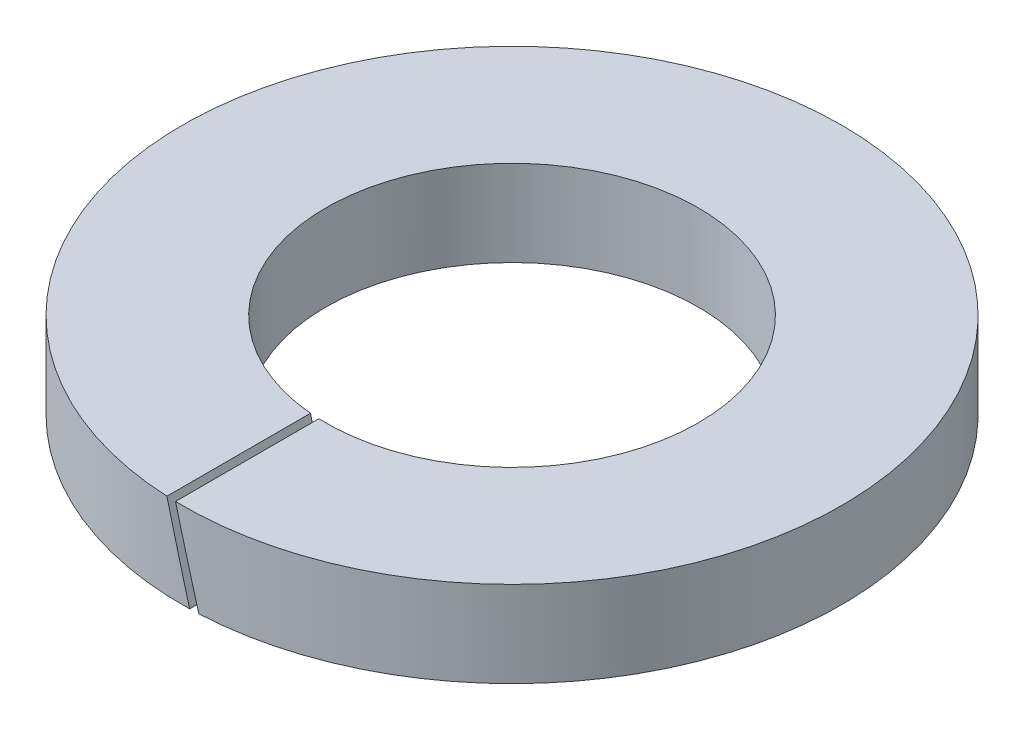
ISO-10303-21;
HEADER;
FILE_DESCRIPTION(('STEP AP214'),'2;1');
FILE_NAME('part.step','',(''),(''),'','','');
FILE_SCHEMA(('AUTOMOTIVE_DESIGN { 1 0 10303 214 1 1 1 1 }'));
ENDSEC;
DATA;
#1=APPLICATION_CONTEXT('core data for automotive mechanical design processes');
#2=APPLICATION_PROTOCOL_DEFINITION('international standard','automotive_design',2000,#1);
#3=PRODUCT_CONTEXT('',#1,'mechanical');
#4=PRODUCT('Part','Part','',(#3));
#5=PRODUCT_RELATED_PRODUCT_CATEGORY('part','',(#4));
#6=PRODUCT_DEFINITION_FORMATION('','',#4);
#7=PRODUCT_DEFINITION_CONTEXT('part definition',#1,'design');
#8=PRODUCT_DEFINITION('design','',#6,#7);
#9=PRODUCT_DEFINITION_SHAPE('','',#8);
#10=(LENGTH_UNIT() NAMED_UNIT(*) SI_UNIT(.MILLI.,.METRE.));
#11=(NAMED_UNIT(*) PLANE_ANGLE_UNIT() SI_UNIT($,.RADIAN.));
#12=(NAMED_UNIT(*) SI_UNIT($,.STERADIAN.) SOLID_ANGLE_UNIT());
#13=UNCERTAINTY_MEASURE_WITH_UNIT(LENGTH_MEASURE(1.E-05),#10,'distance_accuracy_value','');
#14=(GEOMETRIC_REPRESENTATION_CONTEXT(3) GLOBAL_UNCERTAINTY_ASSIGNED_CONTEXT((#13)) GLOBAL_UNIT_ASSIGNED_CONTEXT((#10,
#11,#12)) REPRESENTATION_CONTEXT('',''));
#15=CARTESIAN_POINT('',(0.,0.,0.));
#16=DIRECTION('',(0.,0.,1.));
#17=DIRECTION('',(1.,0.,0.));
#18=AXIS2_PLACEMENT_3D('',#15,#16,#17);
#19=CARTESIAN_POINT('',(0.,0.5,0.));
#20=DIRECTION('',(0.,1.,0.));
#21=DIRECTION('',(0.,0.,1.));
#22=AXIS2_PLACEMENT_3D('',#19,#20,#21);
#23=CYLINDRICAL_SURFACE('',#22,6.5);
#24=CARTESIAN_POINT('',(0.,2.07955549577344,0.));
#25=DIRECTION('',(-0.965925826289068,-0.258819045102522,0.));
#26=DIRECTION('',(-0.258819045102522,0.965925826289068,0.));
#27=AXIS2_PLACEMENT_3D('',#24,#25,#26);
#28=ELLIPSE('',#27,25.1140714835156,6.5);
#29=CARTESIAN_POINT('',(0.5572152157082,0.,6.47607220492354));
#30=VERTEX_POINT('',#29);
#31=CARTESIAN_POINT('',(-0.246632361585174,3.,6.49531927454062));
#32=VERTEX_POINT('',#31);
#33=EDGE_CURVE('E47',#30,#32,#28,.T.);
#34=ORIENTED_EDGE('',*,*,#33,.T.);
#35=CARTESIAN_POINT('',(0.,3.,0.));
#36=DIRECTION('',(0.,1.,0.));
#37=DIRECTION('',(0.,0.,1.));
#38=AXIS2_PLACEMENT_3D('',#35,#36,#37);
#39=CIRCLE('',#38,6.5);
#40=CARTESIAN_POINT('',(-0.557215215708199,3.,6.47607220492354));
#41=VERTEX_POINT('',#40);
#42=EDGE_CURVE('E11',#32,#41,#39,.T.);
#43=ORIENTED_EDGE('',*,*,#42,.T.);
#44=CARTESIAN_POINT('',(0.,0.920444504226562,0.));
#45=DIRECTION('',(-0.965925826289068,-0.258819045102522,0.));
#46=DIRECTION('',(-0.258819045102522,0.965925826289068,0.));
#47=AXIS2_PLACEMENT_3D('',#44,#45,#46);
#48=ELLIPSE('',#47,25.1140714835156,6.5);
#49=CARTESIAN_POINT('',(0.246632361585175,0.,6.49531927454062));
#50=VERTEX_POINT('',#49);
#51=EDGE_CURVE('E96',#50,#41,#48,.T.);
#52=ORIENTED_EDGE('',*,*,#51,.F.);
#53=CARTESIAN_POINT('',(0.,0.,0.));
#54=DIRECTION('',(0.,1.,0.));
#55=DIRECTION('',(0.,0.,1.));
#56=AXIS2_PLACEMENT_3D('',#53,#54,#55);
#57=CIRCLE('',#56,6.5);
#58=EDGE_CURVE('E89',#30,#50,#57,.T.);
#59=ORIENTED_EDGE('',*,*,#58,.F.);
#60=EDGE_LOOP('',(#34,#43,#52,#59));
#61=FACE_BOUND('',#60,.T.);
#62=ADVANCED_FACE('F33',(#61),#23,.F.);
#63=CARTESIAN_POINT('',(6.5,3.,0.));
#64=DIRECTION('',(0.,-1.,0.));
#65=DIRECTION('',(0.,0.,-1.));
#66=AXIS2_PLACEMENT_3D('',#63,#64,#65);
#67=PLANE('',#66);
#68=DIRECTION('',(0.,0.,1.));
#69=VECTOR('',#68,1.);
#70=CARTESIAN_POINT('',(-0.246632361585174,3.,-11.501));
#71=LINE('',#70,#69);
#72=CARTESIAN_POINT('',(-0.246632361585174,3.,11.4973550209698));
#73=VERTEX_POINT('',#72);
#74=EDGE_CURVE('E74',#32,#73,#71,.T.);
#75=ORIENTED_EDGE('',*,*,#74,.T.);
#76=CARTESIAN_POINT('',(0.,3.,0.));
#77=DIRECTION('',(0.,1.,0.));
#78=DIRECTION('',(0.,0.,1.));
#79=AXIS2_PLACEMENT_3D('',#76,#77,#78);
#80=CIRCLE('',#79,11.5);
#81=CARTESIAN_POINT('',(-0.557215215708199,3.,11.4864925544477));
#82=VERTEX_POINT('',#81);
#83=EDGE_CURVE('E40',#73,#82,#80,.T.);
#84=ORIENTED_EDGE('',*,*,#83,.T.);
#85=DIRECTION('',(0.,0.,1.));
#86=VECTOR('',#85,1.);
#87=CARTESIAN_POINT('',(-0.557215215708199,3.,-11.501));
#88=LINE('',#87,#86);
#89=EDGE_CURVE('E98',#41,#82,#88,.T.);
#90=ORIENTED_EDGE('',*,*,#89,.F.);
#91=ORIENTED_EDGE('',*,*,#42,.F.);
#92=EDGE_LOOP('',(#75,#84,#90,#91));
#93=FACE_BOUND('',#92,.T.);
#94=ADVANCED_FACE('F84',(#93),#67,.F.);
#95=CARTESIAN_POINT('',(0.,0.5,0.));
#96=DIRECTION('',(0.,1.,0.));
#97=DIRECTION('',(0.,0.,1.));
#98=AXIS2_PLACEMENT_3D('',#95,#96,#97);
#99=CYLINDRICAL_SURFACE('',#98,11.5);
#100=CARTESIAN_POINT('',(0.,2.07955549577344,0.));
#101=DIRECTION('',(-0.965925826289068,-0.258819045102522,0.));
#102=DIRECTION('',(-0.258819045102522,0.965925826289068,0.));
#103=AXIS2_PLACEMENT_3D('',#100,#101,#102);
#104=ELLIPSE('',#103,44.4325880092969,11.5);
#105=CARTESIAN_POINT('',(0.5572152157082,0.,11.4864925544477));
#106=VERTEX_POINT('',#105);
#107=EDGE_CURVE('E71',#73,#106,#104,.F.);
#108=ORIENTED_EDGE('',*,*,#107,.T.);
#109=CARTESIAN_POINT('',(0.,0.,0.));
#110=DIRECTION('',(0.,1.,0.));
#111=DIRECTION('',(0.,0.,1.));
#112=AXIS2_PLACEMENT_3D('',#109,#110,#111);
#113=CIRCLE('',#112,11.5);
#114=CARTESIAN_POINT('',(0.246632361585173,0.,11.4973550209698));
#115=VERTEX_POINT('',#114);
#116=EDGE_CURVE('E88',#106,#115,#113,.T.);
#117=ORIENTED_EDGE('',*,*,#116,.T.);
#118=CARTESIAN_POINT('',(0.,0.920444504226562,0.));
#119=DIRECTION('',(-0.965925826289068,-0.258819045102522,0.));
#120=DIRECTION('',(-0.258819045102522,0.965925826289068,0.));
#121=AXIS2_PLACEMENT_3D('',#118,#119,#120);
#122=ELLIPSE('',#121,44.4325880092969,11.5);
#123=EDGE_CURVE('E55',#82,#115,#122,.F.);
#124=ORIENTED_EDGE('',*,*,#123,.F.);
#125=ORIENTED_EDGE('',*,*,#83,.F.);
#126=EDGE_LOOP('',(#108,#117,#124,#125));
#127=FACE_BOUND('',#126,.T.);
#128=ADVANCED_FACE('F87',(#127),#99,.T.);
#129=CARTESIAN_POINT('',(6.5,0.,0.));
#130=DIRECTION('',(0.,1.,0.));
#131=DIRECTION('',(0.,0.,1.));
#132=AXIS2_PLACEMENT_3D('',#129,#130,#131);
#133=PLANE('',#132);
#134=DIRECTION('',(0.,0.,-1.));
#135=VECTOR('',#134,1.);
#136=CARTESIAN_POINT('',(0.5572152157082,0.,-11.501));
#137=LINE('',#136,#135);
#138=EDGE_CURVE('E75',#106,#30,#137,.T.);
#139=ORIENTED_EDGE('',*,*,#138,.T.);
#140=ORIENTED_EDGE('',*,*,#58,.T.);
#141=DIRECTION('',(0.,0.,-1.));
#142=VECTOR('',#141,1.);
#143=CARTESIAN_POINT('',(0.246632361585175,0.,-11.501));
#144=LINE('',#143,#142);
#145=EDGE_CURVE('E100',#115,#50,#144,.T.);
#146=ORIENTED_EDGE('',*,*,#145,.F.);
#147=ORIENTED_EDGE('',*,*,#116,.F.);
#148=EDGE_LOOP('',(#139,#140,#146,#147));
#149=FACE_BOUND('',#148,.T.);
#150=ADVANCED_FACE('F107',(#149),#133,.F.);
#151=CARTESIAN_POINT('',(-0.14488887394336,1.46117714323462,-11.501));
#152=DIRECTION('',(-0.965925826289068,-0.258819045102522,0.));
#153=DIRECTION('',(0.258819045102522,-0.965925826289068,0.));
#154=AXIS2_PLACEMENT_3D('',#151,#152,#153);
#155=PLANE('',#154);
#156=ORIENTED_EDGE('',*,*,#51,.T.);
#157=ORIENTED_EDGE('',*,*,#89,.T.);
#158=ORIENTED_EDGE('',*,*,#123,.T.);
#159=ORIENTED_EDGE('',*,*,#145,.T.);
#160=EDGE_LOOP('',(#156,#157,#158,#159));
#161=FACE_BOUND('',#160,.T.);
#162=ADVANCED_FACE('F103',(#161),#155,.F.);
#163=CARTESIAN_POINT('',(0.14488887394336,1.53882285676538,-11.501));
#164=DIRECTION('',(-0.965925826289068,-0.258819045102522,0.));
#165=DIRECTION('',(0.258819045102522,-0.965925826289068,0.));
#166=AXIS2_PLACEMENT_3D('',#163,#164,#165);
#167=PLANE('',#166);
#168=ORIENTED_EDGE('',*,*,#138,.F.);
#169=ORIENTED_EDGE('',*,*,#107,.F.);
#170=ORIENTED_EDGE('',*,*,#74,.F.);
#171=ORIENTED_EDGE('',*,*,#33,.F.);
#172=EDGE_LOOP('',(#168,#169,#170,#171));
#173=FACE_BOUND('',#172,.T.);
#174=ADVANCED_FACE('F73',(#173),#167,.T.);
#175=CLOSED_SHELL('',(#62,#94,#128,#150,#162,#174));
#176=MANIFOLD_SOLID_BREP('B2',#175);
#177=ADVANCED_BREP_SHAPE_REPRESENTATION('',(#18,#176),#14);
#178=SHAPE_DEFINITION_REPRESENTATION(#9,#177);
ENDSEC;
END-ISO-10303-21;
